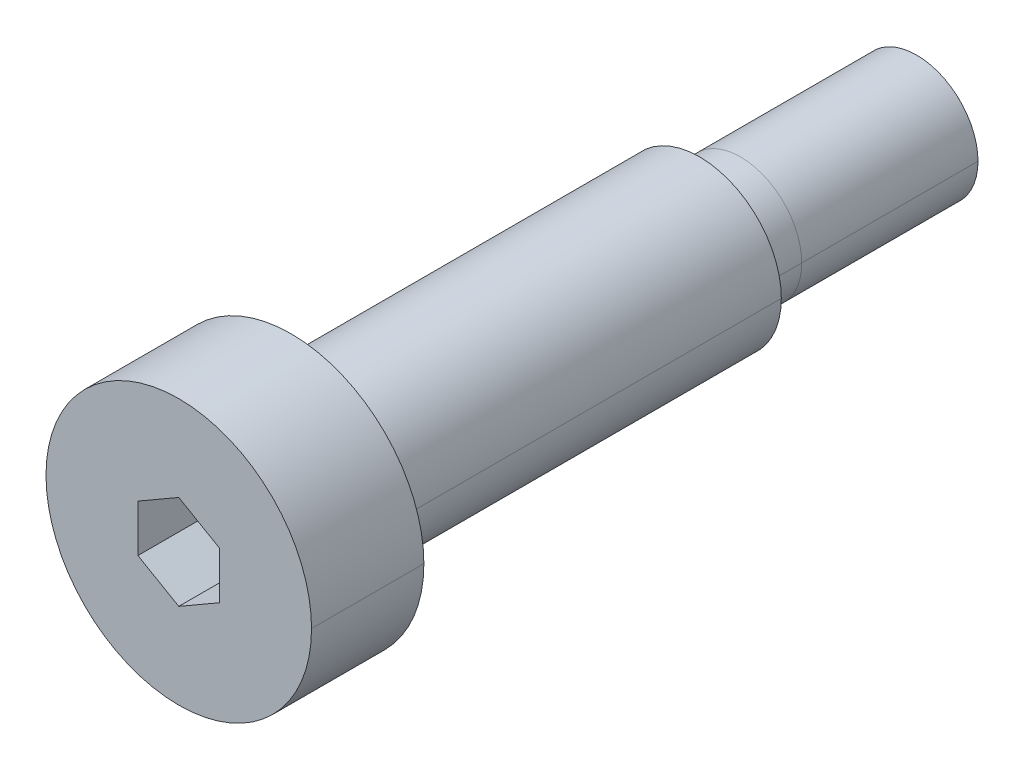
ISO-10303-21;
HEADER;
FILE_DESCRIPTION(('STEP AP214'),'2;1');
FILE_NAME('part.step','',(''),(''),'','','');
FILE_SCHEMA(('AUTOMOTIVE_DESIGN { 1 0 10303 214 1 1 1 1 }'));
ENDSEC;
DATA;
#1=APPLICATION_CONTEXT('core data for automotive mechanical design processes');
#2=APPLICATION_PROTOCOL_DEFINITION('international standard','automotive_design',2000,#1);
#3=PRODUCT_CONTEXT('',#1,'mechanical');
#4=PRODUCT('Part','Part','',(#3));
#5=PRODUCT_RELATED_PRODUCT_CATEGORY('part','',(#4));
#6=PRODUCT_DEFINITION_FORMATION('','',#4);
#7=PRODUCT_DEFINITION_CONTEXT('part definition',#1,'design');
#8=PRODUCT_DEFINITION('design','',#6,#7);
#9=PRODUCT_DEFINITION_SHAPE('','',#8);
#10=(LENGTH_UNIT() NAMED_UNIT(*) SI_UNIT(.MILLI.,.METRE.));
#11=(NAMED_UNIT(*) PLANE_ANGLE_UNIT() SI_UNIT($,.RADIAN.));
#12=(NAMED_UNIT(*) SI_UNIT($,.STERADIAN.) SOLID_ANGLE_UNIT());
#13=UNCERTAINTY_MEASURE_WITH_UNIT(LENGTH_MEASURE(1.E-05),#10,'distance_accuracy_value','');
#14=(GEOMETRIC_REPRESENTATION_CONTEXT(3) GLOBAL_UNCERTAINTY_ASSIGNED_CONTEXT((#13)) GLOBAL_UNIT_ASSIGNED_CONTEXT((#10,
#11,#12)) REPRESENTATION_CONTEXT('',''));
#15=CARTESIAN_POINT('',(0.,0.,0.));
#16=DIRECTION('',(0.,0.,1.));
#17=DIRECTION('',(1.,0.,0.));
#18=AXIS2_PLACEMENT_3D('',#15,#16,#17);
#19=CARTESIAN_POINT('',(0.,0.,-31.));
#20=DIRECTION('',(0.,0.,-1.));
#21=DIRECTION('',(-1.,0.,0.));
#22=AXIS2_PLACEMENT_3D('',#19,#20,#21);
#23=CYLINDRICAL_SURFACE('',#22,2.47);
#24=CARTESIAN_POINT('',(0.,0.,-22.));
#25=DIRECTION('',(0.,0.,-1.));
#26=DIRECTION('',(-1.,0.,0.));
#27=AXIS2_PLACEMENT_3D('',#24,#25,#26);
#28=CIRCLE('',#27,2.47);
#29=CARTESIAN_POINT('',(-2.47,0.,-22.));
#30=VERTEX_POINT('',#29);
#31=CARTESIAN_POINT('',(2.47,0.,-22.));
#32=VERTEX_POINT('',#31);
#33=EDGE_CURVE('P0_E11',#30,#32,#28,.T.);
#34=ORIENTED_EDGE('',*,*,#33,.T.);
#35=DIRECTION('',(0.,0.,-1.));
#36=VECTOR('',#35,1.);
#37=CARTESIAN_POINT('',(2.47,0.,-31.));
#38=LINE('',#37,#36);
#39=CARTESIAN_POINT('',(2.47,0.,-31.));
#40=VERTEX_POINT('',#39);
#41=EDGE_CURVE('P0_E28',#32,#40,#38,.T.);
#42=ORIENTED_EDGE('',*,*,#41,.T.);
#43=CARTESIAN_POINT('',(0.,0.,-31.));
#44=DIRECTION('',(0.,0.,-1.));
#45=DIRECTION('',(-1.,0.,0.));
#46=AXIS2_PLACEMENT_3D('',#43,#44,#45);
#47=CIRCLE('',#46,2.47);
#48=CARTESIAN_POINT('',(-2.47,0.,-31.));
#49=VERTEX_POINT('',#48);
#50=EDGE_CURVE('P0_E267',#49,#40,#47,.T.);
#51=ORIENTED_EDGE('',*,*,#50,.F.);
#52=DIRECTION('',(0.,0.,-1.));
#53=VECTOR('',#52,1.);
#54=CARTESIAN_POINT('',(-2.47,0.,-31.));
#55=LINE('',#54,#53);
#56=EDGE_CURVE('P0_E216',#30,#49,#55,.T.);
#57=ORIENTED_EDGE('',*,*,#56,.F.);
#58=EDGE_LOOP('',(#34,#42,#51,#57));
#59=FACE_BOUND('',#58,.T.);
#60=ADVANCED_FACE('P0_F17',(#59),#23,.T.);
#61=CARTESIAN_POINT('',(0.,0.,-31.));
#62=DIRECTION('',(0.,0.,-1.));
#63=DIRECTION('',(-1.,0.,0.));
#64=AXIS2_PLACEMENT_3D('',#61,#62,#63);
#65=CYLINDRICAL_SURFACE('',#64,6.5);
#66=CARTESIAN_POINT('',(0.,0.,5.5));
#67=DIRECTION('',(0.,0.,-1.));
#68=DIRECTION('',(-1.,0.,0.));
#69=AXIS2_PLACEMENT_3D('',#66,#67,#68);
#70=CIRCLE('',#69,6.5);
#71=CARTESIAN_POINT('',(-6.5,0.,5.5));
#72=VERTEX_POINT('',#71);
#73=CARTESIAN_POINT('',(6.5,0.,5.5));
#74=VERTEX_POINT('',#73);
#75=EDGE_CURVE('P0_E243',#72,#74,#70,.T.);
#76=ORIENTED_EDGE('',*,*,#75,.T.);
#77=DIRECTION('',(0.,0.,-1.));
#78=VECTOR('',#77,1.);
#79=CARTESIAN_POINT('',(6.5,0.,-31.));
#80=LINE('',#79,#78);
#81=CARTESIAN_POINT('',(6.5,0.,0.));
#82=VERTEX_POINT('',#81);
#83=EDGE_CURVE('P0_E229',#74,#82,#80,.T.);
#84=ORIENTED_EDGE('',*,*,#83,.T.);
#85=CARTESIAN_POINT('',(0.,0.,0.));
#86=DIRECTION('',(0.,0.,-1.));
#87=DIRECTION('',(-1.,0.,0.));
#88=AXIS2_PLACEMENT_3D('',#85,#86,#87);
#89=CIRCLE('',#88,6.5);
#90=CARTESIAN_POINT('',(-6.5,0.,0.));
#91=VERTEX_POINT('',#90);
#92=EDGE_CURVE('P0_E247',#91,#82,#89,.T.);
#93=ORIENTED_EDGE('',*,*,#92,.F.);
#94=DIRECTION('',(0.,0.,-1.));
#95=VECTOR('',#94,1.);
#96=CARTESIAN_POINT('',(-6.5,0.,-31.));
#97=LINE('',#96,#95);
#98=EDGE_CURVE('P0_E213',#72,#91,#97,.T.);
#99=ORIENTED_EDGE('',*,*,#98,.F.);
#100=EDGE_LOOP('',(#76,#84,#93,#99));
#101=FACE_BOUND('',#100,.T.);
#102=ADVANCED_FACE('P0_F329',(#101),#65,.T.);
#103=CARTESIAN_POINT('',(0.,0.,-31.));
#104=DIRECTION('',(0.,0.,-1.));
#105=DIRECTION('',(-1.,0.,0.));
#106=AXIS2_PLACEMENT_3D('',#103,#104,#105);
#107=CYLINDRICAL_SURFACE('',#106,4.);
#108=CARTESIAN_POINT('',(0.,0.,0.));
#109=DIRECTION('',(0.,0.,-1.));
#110=DIRECTION('',(-1.,0.,0.));
#111=AXIS2_PLACEMENT_3D('',#108,#109,#110);
#112=CIRCLE('',#111,4.);
#113=CARTESIAN_POINT('',(-4.,0.,0.));
#114=VERTEX_POINT('',#113);
#115=CARTESIAN_POINT('',(4.,0.,0.));
#116=VERTEX_POINT('',#115);
#117=EDGE_CURVE('P0_E222',#114,#116,#112,.T.);
#118=ORIENTED_EDGE('',*,*,#117,.T.);
#119=DIRECTION('',(0.,0.,-1.));
#120=VECTOR('',#119,1.);
#121=CARTESIAN_POINT('',(4.,0.,-31.));
#122=LINE('',#121,#120);
#123=CARTESIAN_POINT('',(4.,0.,-20.));
#124=VERTEX_POINT('',#123);
#125=EDGE_CURVE('P0_E218',#116,#124,#122,.T.);
#126=ORIENTED_EDGE('',*,*,#125,.T.);
#127=CARTESIAN_POINT('',(0.,0.,-20.));
#128=DIRECTION('',(0.,0.,-1.));
#129=DIRECTION('',(-1.,0.,0.));
#130=AXIS2_PLACEMENT_3D('',#127,#128,#129);
#131=CIRCLE('',#130,4.);
#132=CARTESIAN_POINT('',(-4.,0.,-20.));
#133=VERTEX_POINT('',#132);
#134=EDGE_CURVE('P0_E207',#133,#124,#131,.T.);
#135=ORIENTED_EDGE('',*,*,#134,.F.);
#136=DIRECTION('',(0.,0.,-1.));
#137=VECTOR('',#136,1.);
#138=CARTESIAN_POINT('',(-4.,0.,-31.));
#139=LINE('',#138,#137);
#140=EDGE_CURVE('P0_E72',#114,#133,#139,.T.);
#141=ORIENTED_EDGE('',*,*,#140,.F.);
#142=EDGE_LOOP('',(#118,#126,#135,#141));
#143=FACE_BOUND('',#142,.T.);
#144=ADVANCED_FACE('P0_F311',(#143),#107,.T.);
#145=CARTESIAN_POINT('',(0.,0.,-31.));
#146=DIRECTION('',(0.,0.,-1.));
#147=DIRECTION('',(-1.,0.,0.));
#148=AXIS2_PLACEMENT_3D('',#145,#146,#147);
#149=CYLINDRICAL_SURFACE('',#148,3.);
#150=CARTESIAN_POINT('',(0.,0.,-20.));
#151=DIRECTION('',(0.,0.,-1.));
#152=DIRECTION('',(-1.,0.,0.));
#153=AXIS2_PLACEMENT_3D('',#150,#151,#152);
#154=CIRCLE('',#153,3.);
#155=CARTESIAN_POINT('',(-3.,0.,-20.));
#156=VERTEX_POINT('',#155);
#157=CARTESIAN_POINT('',(3.,0.,-20.));
#158=VERTEX_POINT('',#157);
#159=EDGE_CURVE('P0_E223',#156,#158,#154,.T.);
#160=ORIENTED_EDGE('',*,*,#159,.T.);
#161=DIRECTION('',(0.,0.,-1.));
#162=VECTOR('',#161,1.);
#163=CARTESIAN_POINT('',(3.,0.,-31.));
#164=LINE('',#163,#162);
#165=CARTESIAN_POINT('',(3.,0.,-22.));
#166=VERTEX_POINT('',#165);
#167=EDGE_CURVE('P0_E284',#158,#166,#164,.T.);
#168=ORIENTED_EDGE('',*,*,#167,.T.);
#169=CARTESIAN_POINT('',(0.,0.,-22.));
#170=DIRECTION('',(0.,0.,-1.));
#171=DIRECTION('',(-1.,0.,0.));
#172=AXIS2_PLACEMENT_3D('',#169,#170,#171);
#173=CIRCLE('',#172,3.);
#174=CARTESIAN_POINT('',(-3.,0.,-22.));
#175=VERTEX_POINT('',#174);
#176=EDGE_CURVE('P0_E21',#175,#166,#173,.T.);
#177=ORIENTED_EDGE('',*,*,#176,.F.);
#178=DIRECTION('',(0.,0.,-1.));
#179=VECTOR('',#178,1.);
#180=CARTESIAN_POINT('',(-3.,0.,-31.));
#181=LINE('',#180,#179);
#182=EDGE_CURVE('P0_E203',#156,#175,#181,.T.);
#183=ORIENTED_EDGE('',*,*,#182,.F.);
#184=EDGE_LOOP('',(#160,#168,#177,#183));
#185=FACE_BOUND('',#184,.T.);
#186=ADVANCED_FACE('P0_F350',(#185),#149,.T.);
#187=CARTESIAN_POINT('',(0.,0.,5.5));
#188=DIRECTION('',(0.,0.,-1.));
#189=DIRECTION('',(0.,-1.,0.));
#190=AXIS2_PLACEMENT_3D('',#187,#188,#189);
#191=PLANE('',#190);
#192=ORIENTED_EDGE('',*,*,#75,.F.);
#193=CARTESIAN_POINT('',(0.,0.,5.5));
#194=DIRECTION('',(0.,0.,-1.));
#195=DIRECTION('',(-1.,0.,0.));
#196=AXIS2_PLACEMENT_3D('',#193,#194,#195);
#197=CIRCLE('',#196,6.5);
#198=EDGE_CURVE('P0_E208',#74,#72,#197,.T.);
#199=ORIENTED_EDGE('',*,*,#198,.F.);
#200=EDGE_LOOP('',(#192,#199));
#201=FACE_BOUND('',#200,.T.);
#202=DIRECTION('',(-0.866025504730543,-0.499999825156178,0.));
#203=VECTOR('',#202,1.);
#204=CARTESIAN_POINT('',(-0.999999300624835,1.73205040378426,5.5));
#205=LINE('',#204,#203);
#206=CARTESIAN_POINT('',(0.,2.3094,5.5));
#207=VERTEX_POINT('',#206);
#208=CARTESIAN_POINT('',(-2.,1.1547,5.5));
#209=VERTEX_POINT('',#208);
#210=EDGE_CURVE('P0_E178',#207,#209,#205,.T.);
#211=ORIENTED_EDGE('',*,*,#210,.F.);
#212=DIRECTION('',(-0.866025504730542,0.499999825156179,0.));
#213=VECTOR('',#212,1.);
#214=CARTESIAN_POINT('',(0.999999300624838,1.73205040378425,5.5));
#215=LINE('',#214,#213);
#216=CARTESIAN_POINT('',(2.,1.1547,5.5));
#217=VERTEX_POINT('',#216);
#218=EDGE_CURVE('P0_E175',#217,#207,#215,.T.);
#219=ORIENTED_EDGE('',*,*,#218,.F.);
#220=DIRECTION('',(0.,1.,0.));
#221=VECTOR('',#220,1.);
#222=CARTESIAN_POINT('',(2.,0.,5.5));
#223=LINE('',#222,#221);
#224=CARTESIAN_POINT('',(2.,-1.1547,5.5));
#225=VERTEX_POINT('',#224);
#226=EDGE_CURVE('P0_E161',#225,#217,#223,.T.);
#227=ORIENTED_EDGE('',*,*,#226,.F.);
#228=DIRECTION('',(0.866025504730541,0.499999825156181,0.));
#229=VECTOR('',#228,1.);
#230=CARTESIAN_POINT('',(0.99999930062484,-1.73205040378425,5.5));
#231=LINE('',#230,#229);
#232=CARTESIAN_POINT('',(0.,-2.3094,5.5));
#233=VERTEX_POINT('',#232);
#234=EDGE_CURVE('P0_E274',#233,#225,#231,.T.);
#235=ORIENTED_EDGE('',*,*,#234,.F.);
#236=DIRECTION('',(0.866025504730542,-0.499999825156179,0.));
#237=VECTOR('',#236,1.);
#238=CARTESIAN_POINT('',(-0.999999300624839,-1.73205040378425,5.5));
#239=LINE('',#238,#237);
#240=CARTESIAN_POINT('',(-1.99999860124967,-1.1547008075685,5.5));
#241=VERTEX_POINT('',#240);
#242=EDGE_CURVE('P0_E198',#241,#233,#239,.T.);
#243=ORIENTED_EDGE('',*,*,#242,.F.);
#244=DIRECTION('',(6.05676730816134E-07,-0.999999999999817,0.));
#245=VECTOR('',#244,1.);
#246=CARTESIAN_POINT('',(-1.99999930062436,-1.21135303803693E-06,5.5));
#247=LINE('',#246,#245);
#248=EDGE_CURVE('P0_E242',#209,#241,#247,.T.);
#249=ORIENTED_EDGE('',*,*,#248,.F.);
#250=EDGE_LOOP('',(#211,#219,#227,#235,#243,#249));
#251=FACE_BOUND('',#250,.T.);
#252=ADVANCED_FACE('P0_F176',(#201,#251),#191,.F.);
#253=CARTESIAN_POINT('',(3.,0.,-22.));
#254=DIRECTION('',(0.,0.,1.));
#255=DIRECTION('',(1.,0.,0.));
#256=AXIS2_PLACEMENT_3D('',#253,#254,#255);
#257=PLANE('',#256);
#258=ORIENTED_EDGE('',*,*,#176,.T.);
#259=CARTESIAN_POINT('',(0.,0.,-22.));
#260=DIRECTION('',(0.,0.,-1.));
#261=DIRECTION('',(-1.,0.,0.));
#262=AXIS2_PLACEMENT_3D('',#259,#260,#261);
#263=CIRCLE('',#262,3.);
#264=EDGE_CURVE('P0_E230',#166,#175,#263,.T.);
#265=ORIENTED_EDGE('',*,*,#264,.T.);
#266=EDGE_LOOP('',(#258,#265));
#267=FACE_BOUND('',#266,.T.);
#268=ORIENTED_EDGE('',*,*,#33,.F.);
#269=CARTESIAN_POINT('',(0.,0.,-22.));
#270=DIRECTION('',(0.,0.,-1.));
#271=DIRECTION('',(-1.,0.,0.));
#272=AXIS2_PLACEMENT_3D('',#269,#270,#271);
#273=CIRCLE('',#272,2.47);
#274=EDGE_CURVE('P0_E226',#32,#30,#273,.T.);
#275=ORIENTED_EDGE('',*,*,#274,.F.);
#276=EDGE_LOOP('',(#268,#275));
#277=FACE_BOUND('',#276,.T.);
#278=ADVANCED_FACE('P0_F348',(#267,#277),#257,.F.);
#279=CARTESIAN_POINT('',(0.,0.,-31.));
#280=DIRECTION('',(0.,0.,-1.));
#281=DIRECTION('',(-1.,0.,0.));
#282=AXIS2_PLACEMENT_3D('',#279,#280,#281);
#283=CYLINDRICAL_SURFACE('',#282,3.);
#284=ORIENTED_EDGE('',*,*,#167,.F.);
#285=CARTESIAN_POINT('',(0.,0.,-20.));
#286=DIRECTION('',(0.,0.,-1.));
#287=DIRECTION('',(-1.,0.,0.));
#288=AXIS2_PLACEMENT_3D('',#285,#286,#287);
#289=CIRCLE('',#288,3.);
#290=EDGE_CURVE('P0_E206',#158,#156,#289,.T.);
#291=ORIENTED_EDGE('',*,*,#290,.T.);
#292=ORIENTED_EDGE('',*,*,#182,.T.);
#293=ORIENTED_EDGE('',*,*,#264,.F.);
#294=EDGE_LOOP('',(#284,#291,#292,#293));
#295=FACE_BOUND('',#294,.T.);
#296=ADVANCED_FACE('P0_F324',(#295),#283,.T.);
#297=CARTESIAN_POINT('',(4.,0.,-20.));
#298=DIRECTION('',(0.,0.,1.));
#299=DIRECTION('',(1.,0.,0.));
#300=AXIS2_PLACEMENT_3D('',#297,#298,#299);
#301=PLANE('',#300);
#302=ORIENTED_EDGE('',*,*,#134,.T.);
#303=CARTESIAN_POINT('',(0.,0.,-20.));
#304=DIRECTION('',(0.,0.,-1.));
#305=DIRECTION('',(-1.,0.,0.));
#306=AXIS2_PLACEMENT_3D('',#303,#304,#305);
#307=CIRCLE('',#306,4.);
#308=EDGE_CURVE('P0_E280',#124,#133,#307,.T.);
#309=ORIENTED_EDGE('',*,*,#308,.T.);
#310=EDGE_LOOP('',(#302,#309));
#311=FACE_BOUND('',#310,.T.);
#312=ORIENTED_EDGE('',*,*,#159,.F.);
#313=ORIENTED_EDGE('',*,*,#290,.F.);
#314=EDGE_LOOP('',(#312,#313));
#315=FACE_BOUND('',#314,.T.);
#316=ADVANCED_FACE('P0_F309',(#311,#315),#301,.F.);
#317=CARTESIAN_POINT('',(0.,0.,-31.));
#318=DIRECTION('',(0.,0.,-1.));
#319=DIRECTION('',(-1.,0.,0.));
#320=AXIS2_PLACEMENT_3D('',#317,#318,#319);
#321=CYLINDRICAL_SURFACE('',#320,4.);
#322=ORIENTED_EDGE('',*,*,#125,.F.);
#323=CARTESIAN_POINT('',(0.,0.,0.));
#324=DIRECTION('',(0.,0.,-1.));
#325=DIRECTION('',(-1.,0.,0.));
#326=AXIS2_PLACEMENT_3D('',#323,#324,#325);
#327=CIRCLE('',#326,4.);
#328=EDGE_CURVE('P0_E277',#116,#114,#327,.T.);
#329=ORIENTED_EDGE('',*,*,#328,.T.);
#330=ORIENTED_EDGE('',*,*,#140,.T.);
#331=ORIENTED_EDGE('',*,*,#308,.F.);
#332=EDGE_LOOP('',(#322,#329,#330,#331));
#333=FACE_BOUND('',#332,.T.);
#334=ADVANCED_FACE('P0_F313',(#333),#321,.T.);
#335=CARTESIAN_POINT('',(6.5,0.,0.));
#336=DIRECTION('',(0.,0.,1.));
#337=DIRECTION('',(1.,0.,0.));
#338=AXIS2_PLACEMENT_3D('',#335,#336,#337);
#339=PLANE('',#338);
#340=ORIENTED_EDGE('',*,*,#92,.T.);
#341=CARTESIAN_POINT('',(0.,0.,0.));
#342=DIRECTION('',(0.,0.,-1.));
#343=DIRECTION('',(-1.,0.,0.));
#344=AXIS2_PLACEMENT_3D('',#341,#342,#343);
#345=CIRCLE('',#344,6.5);
#346=EDGE_CURVE('P0_E212',#82,#91,#345,.T.);
#347=ORIENTED_EDGE('',*,*,#346,.T.);
#348=EDGE_LOOP('',(#340,#347));
#349=FACE_BOUND('',#348,.T.);
#350=ORIENTED_EDGE('',*,*,#117,.F.);
#351=ORIENTED_EDGE('',*,*,#328,.F.);
#352=EDGE_LOOP('',(#350,#351));
#353=FACE_BOUND('',#352,.T.);
#354=ADVANCED_FACE('P0_F19',(#349,#353),#339,.F.);
#355=CARTESIAN_POINT('',(0.,0.,-31.));
#356=DIRECTION('',(0.,0.,-1.));
#357=DIRECTION('',(-1.,0.,0.));
#358=AXIS2_PLACEMENT_3D('',#355,#356,#357);
#359=CYLINDRICAL_SURFACE('',#358,6.5);
#360=ORIENTED_EDGE('',*,*,#83,.F.);
#361=ORIENTED_EDGE('',*,*,#198,.T.);
#362=ORIENTED_EDGE('',*,*,#98,.T.);
#363=ORIENTED_EDGE('',*,*,#346,.F.);
#364=EDGE_LOOP('',(#360,#361,#362,#363));
#365=FACE_BOUND('',#364,.T.);
#366=ADVANCED_FACE('P0_F322',(#365),#359,.T.);
#367=CARTESIAN_POINT('',(2.47,0.,-31.));
#368=DIRECTION('',(0.,0.,1.));
#369=DIRECTION('',(1.,0.,0.));
#370=AXIS2_PLACEMENT_3D('',#367,#368,#369);
#371=PLANE('',#370);
#372=ORIENTED_EDGE('',*,*,#50,.T.);
#373=CARTESIAN_POINT('',(0.,0.,-31.));
#374=DIRECTION('',(0.,0.,-1.));
#375=DIRECTION('',(-1.,0.,0.));
#376=AXIS2_PLACEMENT_3D('',#373,#374,#375);
#377=CIRCLE('',#376,2.47);
#378=EDGE_CURVE('P0_E263',#40,#49,#377,.T.);
#379=ORIENTED_EDGE('',*,*,#378,.T.);
#380=EDGE_LOOP('',(#372,#379));
#381=FACE_BOUND('',#380,.T.);
#382=ADVANCED_FACE('P0_F357',(#381),#371,.F.);
#383=CARTESIAN_POINT('',(0.,0.,-31.));
#384=DIRECTION('',(0.,0.,-1.));
#385=DIRECTION('',(-1.,0.,0.));
#386=AXIS2_PLACEMENT_3D('',#383,#384,#385);
#387=CYLINDRICAL_SURFACE('',#386,2.47);
#388=ORIENTED_EDGE('',*,*,#41,.F.);
#389=ORIENTED_EDGE('',*,*,#274,.T.);
#390=ORIENTED_EDGE('',*,*,#56,.T.);
#391=ORIENTED_EDGE('',*,*,#378,.F.);
#392=EDGE_LOOP('',(#388,#389,#390,#391));
#393=FACE_BOUND('',#392,.T.);
#394=ADVANCED_FACE('P0_F354',(#393),#387,.T.);
#395=CARTESIAN_POINT('',(-2.,1.1547,2.49999999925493));
#396=DIRECTION('',(0.499999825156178,-0.866025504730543,0.));
#397=DIRECTION('',(0.,0.,-1.));
#398=AXIS2_PLACEMENT_3D('',#395,#396,#397);
#399=PLANE('',#398);
#400=ORIENTED_EDGE('',*,*,#210,.T.);
#401=DIRECTION('',(0.,0.,1.));
#402=VECTOR('',#401,1.);
#403=CARTESIAN_POINT('',(-2.,1.1547,2.49999999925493));
#404=LINE('',#403,#402);
#405=CARTESIAN_POINT('',(-2.,1.1547,2.49999999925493));
#406=VERTEX_POINT('',#405);
#407=EDGE_CURVE('P0_E258',#406,#209,#404,.T.);
#408=ORIENTED_EDGE('',*,*,#407,.F.);
#409=DIRECTION('',(0.866025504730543,0.499999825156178,0.));
#410=VECTOR('',#409,1.);
#411=CARTESIAN_POINT('',(-2.,1.1547,2.49999999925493));
#412=LINE('',#411,#410);
#413=CARTESIAN_POINT('',(0.,2.3094,2.49999999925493));
#414=VERTEX_POINT('',#413);
#415=EDGE_CURVE('P0_E217',#406,#414,#412,.T.);
#416=ORIENTED_EDGE('',*,*,#415,.T.);
#417=DIRECTION('',(0.,0.,1.));
#418=VECTOR('',#417,1.);
#419=CARTESIAN_POINT('',(0.,2.3094,2.49999999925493));
#420=LINE('',#419,#418);
#421=EDGE_CURVE('P0_E182',#414,#207,#420,.T.);
#422=ORIENTED_EDGE('',*,*,#421,.T.);
#423=EDGE_LOOP('',(#400,#408,#416,#422));
#424=FACE_BOUND('',#423,.T.);
#425=ADVANCED_FACE('P0_F356',(#424),#399,.T.);
#426=CARTESIAN_POINT('',(0.,2.3094,2.49999999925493));
#427=DIRECTION('',(-0.499999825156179,-0.866025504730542,0.));
#428=DIRECTION('',(-0.866025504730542,0.499999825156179,0.));
#429=AXIS2_PLACEMENT_3D('',#426,#427,#428);
#430=PLANE('',#429);
#431=ORIENTED_EDGE('',*,*,#218,.T.);
#432=ORIENTED_EDGE('',*,*,#421,.F.);
#433=DIRECTION('',(0.866025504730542,-0.499999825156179,0.));
#434=VECTOR('',#433,1.);
#435=CARTESIAN_POINT('',(0.,2.3094,2.49999999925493));
#436=LINE('',#435,#434);
#437=CARTESIAN_POINT('',(2.,1.1547,2.49999999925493));
#438=VERTEX_POINT('',#437);
#439=EDGE_CURVE('P0_E183',#414,#438,#436,.T.);
#440=ORIENTED_EDGE('',*,*,#439,.T.);
#441=DIRECTION('',(0.,0.,1.));
#442=VECTOR('',#441,1.);
#443=CARTESIAN_POINT('',(2.,1.1547,2.49999999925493));
#444=LINE('',#443,#442);
#445=EDGE_CURVE('P0_E166',#438,#217,#444,.T.);
#446=ORIENTED_EDGE('',*,*,#445,.T.);
#447=EDGE_LOOP('',(#431,#432,#440,#446));
#448=FACE_BOUND('',#447,.T.);
#449=ADVANCED_FACE('P0_F185',(#448),#430,.T.);
#450=CARTESIAN_POINT('',(2.,1.1547,2.49999999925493));
#451=DIRECTION('',(-1.,0.,0.));
#452=DIRECTION('',(0.,1.,0.));
#453=AXIS2_PLACEMENT_3D('',#450,#451,#452);
#454=PLANE('',#453);
#455=ORIENTED_EDGE('',*,*,#226,.T.);
#456=ORIENTED_EDGE('',*,*,#445,.F.);
#457=DIRECTION('',(0.,-1.,0.));
#458=VECTOR('',#457,1.);
#459=CARTESIAN_POINT('',(2.,1.1547,2.49999999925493));
#460=LINE('',#459,#458);
#461=CARTESIAN_POINT('',(2.,-1.1547,2.49999999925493));
#462=VERTEX_POINT('',#461);
#463=EDGE_CURVE('P0_E172',#438,#462,#460,.T.);
#464=ORIENTED_EDGE('',*,*,#463,.T.);
#465=DIRECTION('',(0.,0.,1.));
#466=VECTOR('',#465,1.);
#467=CARTESIAN_POINT('',(2.,-1.1547,2.49999999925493));
#468=LINE('',#467,#466);
#469=EDGE_CURVE('P0_E168',#462,#225,#468,.T.);
#470=ORIENTED_EDGE('',*,*,#469,.T.);
#471=EDGE_LOOP('',(#455,#456,#464,#470));
#472=FACE_BOUND('',#471,.T.);
#473=ADVANCED_FACE('P0_F163',(#472),#454,.T.);
#474=CARTESIAN_POINT('',(2.,-1.1547,2.49999999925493));
#475=DIRECTION('',(-0.499999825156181,0.866025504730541,0.));
#476=DIRECTION('',(0.,0.,1.));
#477=AXIS2_PLACEMENT_3D('',#474,#475,#476);
#478=PLANE('',#477);
#479=ORIENTED_EDGE('',*,*,#234,.T.);
#480=ORIENTED_EDGE('',*,*,#469,.F.);
#481=DIRECTION('',(-0.866025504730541,-0.499999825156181,0.));
#482=VECTOR('',#481,1.);
#483=CARTESIAN_POINT('',(2.,-1.1547,2.49999999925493));
#484=LINE('',#483,#482);
#485=CARTESIAN_POINT('',(0.,-2.3094,2.49999999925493));
#486=VERTEX_POINT('',#485);
#487=EDGE_CURVE('P0_E236',#462,#486,#484,.T.);
#488=ORIENTED_EDGE('',*,*,#487,.T.);
#489=DIRECTION('',(0.,0.,1.));
#490=VECTOR('',#489,1.);
#491=CARTESIAN_POINT('',(0.,-2.3094,2.49999999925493));
#492=LINE('',#491,#490);
#493=EDGE_CURVE('P0_E201',#486,#233,#492,.T.);
#494=ORIENTED_EDGE('',*,*,#493,.T.);
#495=EDGE_LOOP('',(#479,#480,#488,#494));
#496=FACE_BOUND('',#495,.T.);
#497=ADVANCED_FACE('P0_F344',(#496),#478,.T.);
#498=CARTESIAN_POINT('',(0.,-2.3094,2.49999999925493));
#499=DIRECTION('',(0.499999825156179,0.866025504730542,0.));
#500=DIRECTION('',(0.,0.,-1.));
#501=AXIS2_PLACEMENT_3D('',#498,#499,#500);
#502=PLANE('',#501);
#503=ORIENTED_EDGE('',*,*,#242,.T.);
#504=ORIENTED_EDGE('',*,*,#493,.F.);
#505=DIRECTION('',(-0.866025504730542,0.499999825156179,0.));
#506=VECTOR('',#505,1.);
#507=CARTESIAN_POINT('',(0.,-2.3094,2.49999999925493));
#508=LINE('',#507,#506);
#509=CARTESIAN_POINT('',(-1.99999860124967,-1.1547008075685,2.49999999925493));
#510=VERTEX_POINT('',#509);
#511=EDGE_CURVE('P0_E202',#486,#510,#508,.T.);
#512=ORIENTED_EDGE('',*,*,#511,.T.);
#513=DIRECTION('',(0.,0.,1.));
#514=VECTOR('',#513,1.);
#515=CARTESIAN_POINT('',(-1.99999860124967,-1.1547008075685,2.49999999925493));
#516=LINE('',#515,#514);
#517=EDGE_CURVE('P0_E238',#510,#241,#516,.T.);
#518=ORIENTED_EDGE('',*,*,#517,.T.);
#519=EDGE_LOOP('',(#503,#504,#512,#518));
#520=FACE_BOUND('',#519,.T.);
#521=ADVANCED_FACE('P0_F340',(#520),#502,.T.);
#522=CARTESIAN_POINT('',(-1.99999860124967,-1.1547008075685,2.49999999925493));
#523=DIRECTION('',(0.999999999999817,6.05676730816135E-07,0.));
#524=DIRECTION('',(0.,0.,-1.));
#525=AXIS2_PLACEMENT_3D('',#522,#523,#524);
#526=PLANE('',#525);
#527=ORIENTED_EDGE('',*,*,#248,.T.);
#528=ORIENTED_EDGE('',*,*,#517,.F.);
#529=DIRECTION('',(-6.05676730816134E-07,0.999999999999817,0.));
#530=VECTOR('',#529,1.);
#531=CARTESIAN_POINT('',(-1.99999860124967,-1.1547008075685,2.49999999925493));
#532=LINE('',#531,#530);
#533=EDGE_CURVE('P0_E255',#510,#406,#532,.T.);
#534=ORIENTED_EDGE('',*,*,#533,.T.);
#535=ORIENTED_EDGE('',*,*,#407,.T.);
#536=EDGE_LOOP('',(#527,#528,#534,#535));
#537=FACE_BOUND('',#536,.T.);
#538=ADVANCED_FACE('P0_F343',(#537),#526,.T.);
#539=CARTESIAN_POINT('',(0.,0.,2.49999999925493));
#540=DIRECTION('',(0.,0.,1.));
#541=DIRECTION('',(1.,0.,0.));
#542=AXIS2_PLACEMENT_3D('',#539,#540,#541);
#543=PLANE('',#542);
#544=ORIENTED_EDGE('',*,*,#415,.F.);
#545=ORIENTED_EDGE('',*,*,#533,.F.);
#546=ORIENTED_EDGE('',*,*,#511,.F.);
#547=ORIENTED_EDGE('',*,*,#487,.F.);
#548=ORIENTED_EDGE('',*,*,#463,.F.);
#549=ORIENTED_EDGE('',*,*,#439,.F.);
#550=EDGE_LOOP('',(#544,#545,#546,#547,#548,#549));
#551=FACE_BOUND('',#550,.T.);
#552=ADVANCED_FACE('P0_F380',(#551),#543,.T.);
#553=CLOSED_SHELL('',(#60,#102,#144,#186,#252,#278,#296,#316,#334,#354,#366,#382,#394,#425,#449,
#473,#497,#521,#538,#552));
#554=MANIFOLD_SOLID_BREP('P0_B1',#553);
#555=CARTESIAN_POINT('',(0.,0.,-9.));
#556=DIRECTION('',(0.,0.,1.));
#557=DIRECTION('',(1.,0.,0.));
#558=AXIS2_PLACEMENT_3D('',#555,#556,#557);
#559=CYLINDRICAL_SURFACE('',#558,3.);
#560=CARTESIAN_POINT('',(0.,0.,-30.6288900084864));
#561=DIRECTION('',(0.,0.,1.));
#562=DIRECTION('',(1.,0.,0.));
#563=AXIS2_PLACEMENT_3D('',#560,#561,#562);
#564=CIRCLE('',#563,3.);
#565=CARTESIAN_POINT('',(3.,0.,-30.6288900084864));
#566=VERTEX_POINT('',#565);
#567=CARTESIAN_POINT('',(-3.,0.,-30.6288900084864));
#568=VERTEX_POINT('',#567);
#569=EDGE_CURVE('P1_E11',#566,#568,#564,.T.);
#570=ORIENTED_EDGE('',*,*,#569,.T.);
#571=DIRECTION('',(0.,0.,1.));
#572=VECTOR('',#571,1.);
#573=CARTESIAN_POINT('',(-3.,0.,-9.));
#574=LINE('',#573,#572);
#575=CARTESIAN_POINT('',(-3.,0.,-22.));
#576=VERTEX_POINT('',#575);
#577=EDGE_CURVE('P1_E28',#568,#576,#574,.T.);
#578=ORIENTED_EDGE('',*,*,#577,.T.);
#579=CARTESIAN_POINT('',(0.,0.,-22.));
#580=DIRECTION('',(0.,0.,1.));
#581=DIRECTION('',(1.,0.,0.));
#582=AXIS2_PLACEMENT_3D('',#579,#580,#581);
#583=CIRCLE('',#582,3.);
#584=CARTESIAN_POINT('',(3.,0.,-22.));
#585=VERTEX_POINT('',#584);
#586=EDGE_CURVE('P1_E129',#585,#576,#583,.T.);
#587=ORIENTED_EDGE('',*,*,#586,.F.);
#588=DIRECTION('',(0.,0.,1.));
#589=VECTOR('',#588,1.);
#590=CARTESIAN_POINT('',(3.,0.,-9.));
#591=LINE('',#590,#589);
#592=EDGE_CURVE('P1_E21',#566,#585,#591,.T.);
#593=ORIENTED_EDGE('',*,*,#592,.F.);
#594=EDGE_LOOP('',(#570,#578,#587,#593));
#595=FACE_BOUND('',#594,.T.);
#596=ADVANCED_FACE('P1_F17',(#595),#559,.T.);
#597=CARTESIAN_POINT('',(0.,0.,-9.));
#598=DIRECTION('',(0.,0.,1.));
#599=DIRECTION('',(1.,0.,0.));
#600=AXIS2_PLACEMENT_3D('',#597,#598,#599);
#601=CYLINDRICAL_SURFACE('',#600,2.47);
#602=CARTESIAN_POINT('',(0.,0.,-31.));
#603=DIRECTION('',(0.,0.,1.));
#604=DIRECTION('',(1.,0.,0.));
#605=AXIS2_PLACEMENT_3D('',#602,#603,#604);
#606=CIRCLE('',#605,2.47);
#607=CARTESIAN_POINT('',(-2.47,0.,-31.));
#608=VERTEX_POINT('',#607);
#609=CARTESIAN_POINT('',(2.47,0.,-31.));
#610=VERTEX_POINT('',#609);
#611=EDGE_CURVE('P1_E74',#608,#610,#606,.T.);
#612=ORIENTED_EDGE('',*,*,#611,.F.);
#613=DIRECTION('',(0.,0.,1.));
#614=VECTOR('',#613,1.);
#615=CARTESIAN_POINT('',(-2.47,0.,-9.));
#616=LINE('',#615,#614);
#617=CARTESIAN_POINT('',(-2.47,0.,-22.));
#618=VERTEX_POINT('',#617);
#619=EDGE_CURVE('P1_E94',#608,#618,#616,.T.);
#620=ORIENTED_EDGE('',*,*,#619,.T.);
#621=CARTESIAN_POINT('',(0.,0.,-22.));
#622=DIRECTION('',(0.,0.,1.));
#623=DIRECTION('',(1.,0.,0.));
#624=AXIS2_PLACEMENT_3D('',#621,#622,#623);
#625=CIRCLE('',#624,2.47);
#626=CARTESIAN_POINT('',(2.47,0.,-22.));
#627=VERTEX_POINT('',#626);
#628=EDGE_CURVE('P1_E76',#618,#627,#625,.T.);
#629=ORIENTED_EDGE('',*,*,#628,.T.);
#630=DIRECTION('',(0.,0.,1.));
#631=VECTOR('',#630,1.);
#632=CARTESIAN_POINT('',(2.47,0.,-9.));
#633=LINE('',#632,#631);
#634=EDGE_CURVE('P1_E70',#610,#627,#633,.T.);
#635=ORIENTED_EDGE('',*,*,#634,.F.);
#636=EDGE_LOOP('',(#612,#620,#629,#635));
#637=FACE_BOUND('',#636,.T.);
#638=ADVANCED_FACE('P1_F72',(#637),#601,.F.);
#639=CARTESIAN_POINT('',(0.,0.,-30.6288900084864));
#640=DIRECTION('',(0.,0.,1.));
#641=DIRECTION('',(1.,0.,0.));
#642=AXIS2_PLACEMENT_3D('',#639,#640,#641);
#643=CONICAL_SURFACE('',#642,3.,0.959931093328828);
#644=CARTESIAN_POINT('',(0.,0.,-31.));
#645=DIRECTION('',(0.,0.,1.));
#646=DIRECTION('',(1.,0.,0.));
#647=AXIS2_PLACEMENT_3D('',#644,#645,#646);
#648=CIRCLE('',#647,2.47);
#649=EDGE_CURVE('P1_E92',#610,#608,#648,.T.);
#650=ORIENTED_EDGE('',*,*,#649,.T.);
#651=DIRECTION('',(-0.819152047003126,0.,0.573576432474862));
#652=VECTOR('',#651,1.);
#653=CARTESIAN_POINT('',(-3.,0.,-30.6288900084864));
#654=LINE('',#653,#652);
#655=EDGE_CURVE('P1_E42',#608,#568,#654,.T.);
#656=ORIENTED_EDGE('',*,*,#655,.T.);
#657=ORIENTED_EDGE('',*,*,#569,.F.);
#658=DIRECTION('',(0.819152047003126,0.,0.573576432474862));
#659=VECTOR('',#658,1.);
#660=CARTESIAN_POINT('',(3.,0.,-30.6288900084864));
#661=LINE('',#660,#659);
#662=EDGE_CURVE('P1_E82',#610,#566,#661,.T.);
#663=ORIENTED_EDGE('',*,*,#662,.F.);
#664=EDGE_LOOP('',(#650,#656,#657,#663));
#665=FACE_BOUND('',#664,.T.);
#666=ADVANCED_FACE('P1_F96',(#665),#643,.T.);
#667=CARTESIAN_POINT('',(0.,0.,-30.6288900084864));
#668=DIRECTION('',(0.,0.,1.));
#669=DIRECTION('',(1.,0.,0.));
#670=AXIS2_PLACEMENT_3D('',#667,#668,#669);
#671=CONICAL_SURFACE('',#670,3.,0.959931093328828);
#672=ORIENTED_EDGE('',*,*,#655,.F.);
#673=ORIENTED_EDGE('',*,*,#611,.T.);
#674=ORIENTED_EDGE('',*,*,#662,.T.);
#675=CARTESIAN_POINT('',(0.,0.,-30.6288900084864));
#676=DIRECTION('',(0.,0.,1.));
#677=DIRECTION('',(1.,0.,0.));
#678=AXIS2_PLACEMENT_3D('',#675,#676,#677);
#679=CIRCLE('',#678,3.);
#680=EDGE_CURVE('P1_E148',#568,#566,#679,.T.);
#681=ORIENTED_EDGE('',*,*,#680,.F.);
#682=EDGE_LOOP('',(#672,#673,#674,#681));
#683=FACE_BOUND('',#682,.T.);
#684=ADVANCED_FACE('P1_F19',(#683),#671,.T.);
#685=CARTESIAN_POINT('',(0.,0.,-9.));
#686=DIRECTION('',(0.,0.,1.));
#687=DIRECTION('',(1.,0.,0.));
#688=AXIS2_PLACEMENT_3D('',#685,#686,#687);
#689=CYLINDRICAL_SURFACE('',#688,2.47);
#690=ORIENTED_EDGE('',*,*,#619,.F.);
#691=ORIENTED_EDGE('',*,*,#649,.F.);
#692=ORIENTED_EDGE('',*,*,#634,.T.);
#693=CARTESIAN_POINT('',(0.,0.,-22.));
#694=DIRECTION('',(0.,0.,1.));
#695=DIRECTION('',(1.,0.,0.));
#696=AXIS2_PLACEMENT_3D('',#693,#694,#695);
#697=CIRCLE('',#696,2.47);
#698=EDGE_CURVE('P1_E83',#627,#618,#697,.T.);
#699=ORIENTED_EDGE('',*,*,#698,.T.);
#700=EDGE_LOOP('',(#690,#691,#692,#699));
#701=FACE_BOUND('',#700,.T.);
#702=ADVANCED_FACE('P1_F93',(#701),#689,.F.);
#703=CARTESIAN_POINT('',(0.,2.47,-22.));
#704=DIRECTION('',(0.,0.,1.));
#705=DIRECTION('',(1.,0.,0.));
#706=AXIS2_PLACEMENT_3D('',#703,#704,#705);
#707=PLANE('',#706);
#708=ORIENTED_EDGE('',*,*,#586,.T.);
#709=CARTESIAN_POINT('',(0.,0.,-22.));
#710=DIRECTION('',(0.,0.,1.));
#711=DIRECTION('',(1.,0.,0.));
#712=AXIS2_PLACEMENT_3D('',#709,#710,#711);
#713=CIRCLE('',#712,3.);
#714=EDGE_CURVE('P1_E143',#576,#585,#713,.T.);
#715=ORIENTED_EDGE('',*,*,#714,.T.);
#716=EDGE_LOOP('',(#708,#715));
#717=FACE_BOUND('',#716,.T.);
#718=ORIENTED_EDGE('',*,*,#698,.F.);
#719=ORIENTED_EDGE('',*,*,#628,.F.);
#720=EDGE_LOOP('',(#718,#719));
#721=FACE_BOUND('',#720,.T.);
#722=ADVANCED_FACE('P1_F216',(#717,#721),#707,.T.);
#723=CARTESIAN_POINT('',(0.,0.,-9.));
#724=DIRECTION('',(0.,0.,1.));
#725=DIRECTION('',(1.,0.,0.));
#726=AXIS2_PLACEMENT_3D('',#723,#724,#725);
#727=CYLINDRICAL_SURFACE('',#726,3.);
#728=ORIENTED_EDGE('',*,*,#577,.F.);
#729=ORIENTED_EDGE('',*,*,#680,.T.);
#730=ORIENTED_EDGE('',*,*,#592,.T.);
#731=ORIENTED_EDGE('',*,*,#714,.F.);
#732=EDGE_LOOP('',(#728,#729,#730,#731));
#733=FACE_BOUND('',#732,.T.);
#734=ADVANCED_FACE('P1_F227',(#733),#727,.T.);
#735=CLOSED_SHELL('',(#596,#638,#666,#684,#702,#722,#734));
#736=MANIFOLD_SOLID_BREP('P1_B1',#735);
#737=ADVANCED_BREP_SHAPE_REPRESENTATION('',(#18,#554,#736),#14);
#738=SHAPE_DEFINITION_REPRESENTATION(#9,#737);
ENDSEC;
END-ISO-10303-21;
